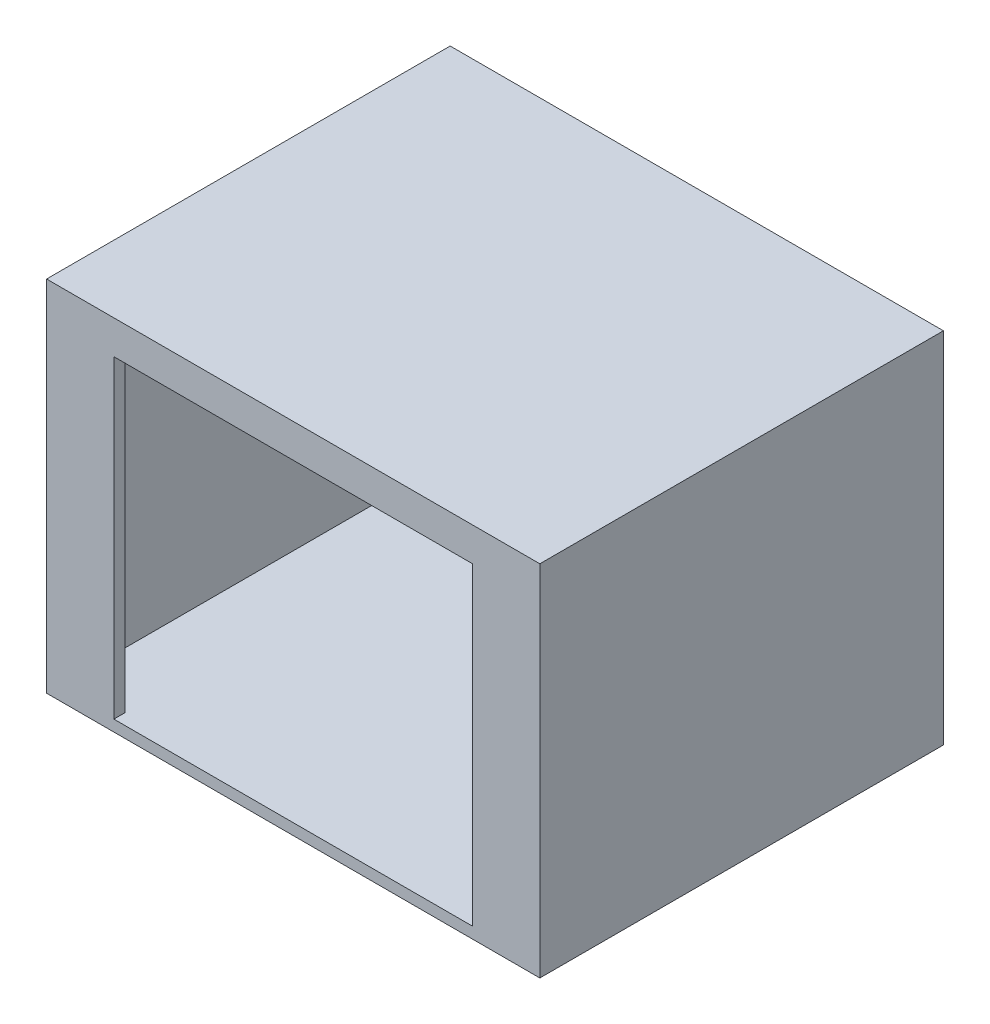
from build123d import *

# Parameters (mm, degrees)
SKETCH1_W          = 558.8
SKETCH1_H          = 457.2
EXTRUDE1_DEPTH     = 406.4
SHELL1_T           = 12.7
CUT_EXTRUDE1_REACH = 674.501
SKETCH2_W          = 406.4
SKETCH2_H          = 355.6


with BuildPart() as part:
    # Sketch1 → Extrude1 (new body)
    with BuildSketch(Plane(origin=(0, 0, 0), x_dir=(1, 0, 0), z_dir=(0, 1, 0))):
        with Locations((0, 228.6)):
            Rectangle(SKETCH1_W, SKETCH1_H)
    extrude(amount=EXTRUDE1_DEPTH)

    # Shell1 (no face opened: a closed hollow body)
    add(offset(amount=-SHELL1_T, mode=Mode.PRIVATE), mode=Mode.SUBTRACT)

    # Sketch2 → Cut-Extrude1 (cut, up to next)
    with BuildSketch(Plane.XY, mode=Mode.PRIVATE) as cut_extrude1_sk1:
        with Locations((0, 190.5)):
            Rectangle(SKETCH2_W, SKETCH2_H)
    cut_extrude1_tool1 = extrude(cut_extrude1_sk1.sketch, amount=-CUT_EXTRUDE1_REACH, mode=Mode.PRIVATE) & part.part
    add(cut_extrude1_tool1.solids().sort_by_distance((0, 190.5, 0))[0], mode=Mode.SUBTRACT)


solid = part.part
